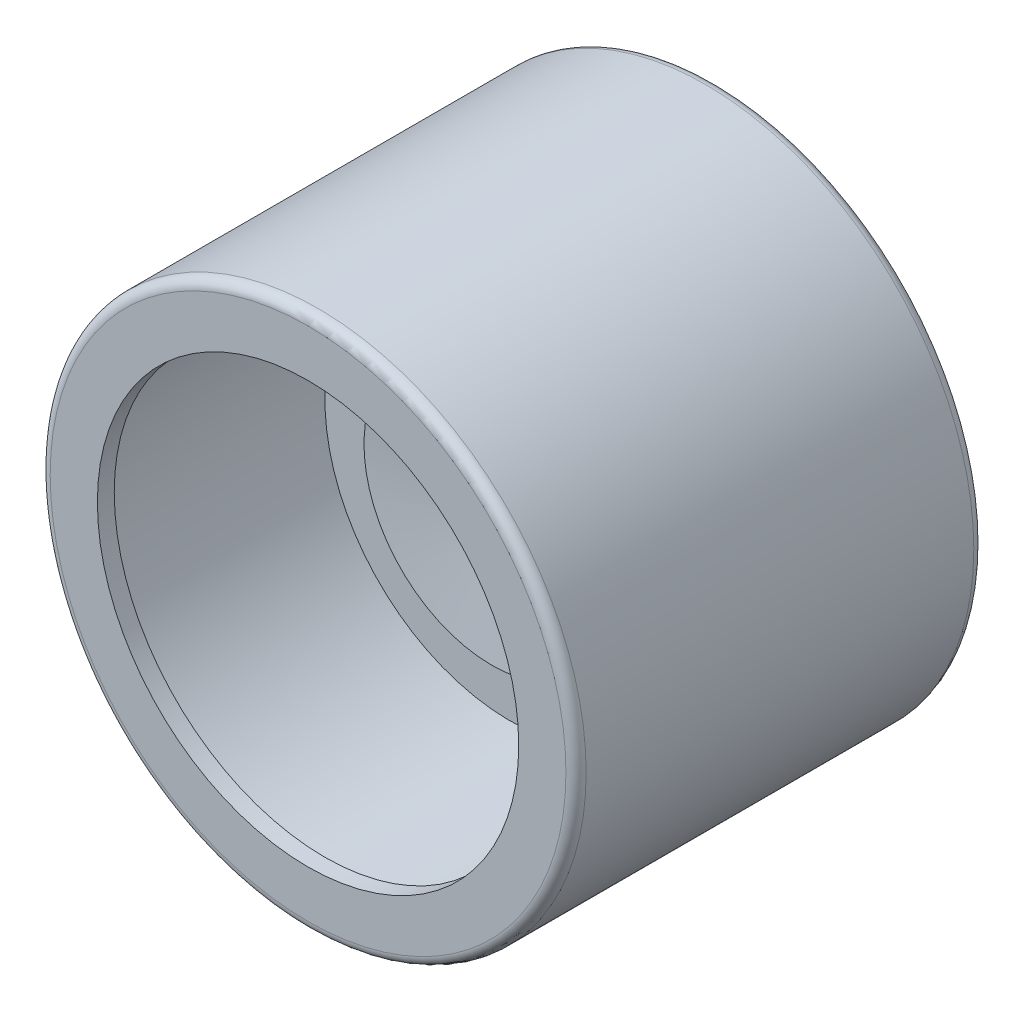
from build123d import *

# Parameters (mm, degrees)
SKETCH1_R           = 7.95
BOSS_EXTRUDE1_DEPTH = 12.1
FILLET1_R           = 0.3
SKETCH3_R           = 7.5
CUT_EXTRUDE2_DEPTH  = 10
SKETCH2_R           = 7.65
SKETCH2_R_2         = 6.25
BOSS_EXTRUDE2_DEPTH = 0.5
SKETCH4_R           = 5.5
BOSS_EXTRUDE3_DEPTH = 4


with BuildPart() as part:
    # Sketch1 → Boss-Extrude1 (new body)
    with BuildSketch(Plane.XY):
        Circle(SKETCH1_R)
    extrude(amount=BOSS_EXTRUDE1_DEPTH)

    # Fillet1
    fillet1_edges = [part.edges().sort_by_distance(p)[0] for p in [
        (-7.95, 0, 0),
        (-7.95, 0, 12.1),
    ]]
    fillet(fillet1_edges, radius=FILLET1_R)

    # Sketch3 → Cut-Extrude2 (cut)
    with BuildSketch(Plane.XY.offset(12.1)):
        Circle(SKETCH3_R)
    extrude(amount=-CUT_EXTRUDE2_DEPTH, mode=Mode.SUBTRACT)

    # Sketch2 → Boss-Extrude2 (add)
    with BuildSketch(Plane.XY.offset(12.1)):
        Circle(SKETCH2_R)
        Circle(SKETCH2_R_2, mode=Mode.SUBTRACT)
    extrude(amount=-BOSS_EXTRUDE2_DEPTH)

    # Sketch4 → Boss-Extrude3 (add)
    with BuildSketch(Plane.XY.offset(2.1)):
        Circle(SKETCH4_R)
    extrude(amount=BOSS_EXTRUDE3_DEPTH)

    # Sketch6 → Revolve2 (revolve)
    with BuildSketch(Plane(origin=(0, 0, 0), x_dir=(0, 0, -1), z_dir=(1, 0, 0)), mode=Mode.PRIVATE) as revolve2_sk:
        with BuildLine():
            Line((-5.5, 3.790901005), (-5.5, 0))
            Line((-5.5, 0), (-6, 0))
            Line((-6, 0), (-6, 0.25))
            Line((-6, 0.25), (-6.119453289, 0.451240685))
            ThreePointArc((-6.119453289, 0.451240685), (-6.249755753, 0.734093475), (-6.318842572, 1.03775685))
            Line((-6.318842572, 1.03775685), (-6.65, 3.790901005))
            Line((-6.65, 3.790901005), (-5.5, 3.790901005))
        make_face()
    revolve(revolve2_sk.sketch.rotate(Axis((0, 0, 0), (0, 0, 1)), 270), axis=Axis((0, 0, 0), (0, 0, 1)))


solid = part.part
